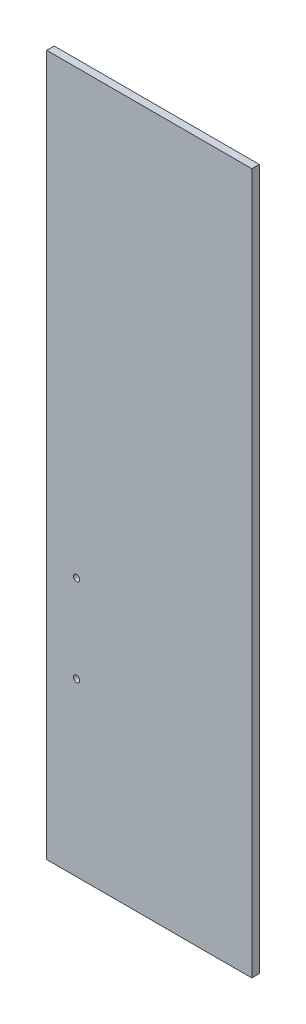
from build123d import *

# Parameters (mm, degrees)
ESQUISSE1_W                           = 275
ESQUISSE1_H                           = 940
EXTRUSION1_DEPTH                      = 10
DIAM_TRE_DU_PER_AGE_M8_5_8_500000_1_D = 8.5


with BuildPart() as part:
    # Esquisse1 → Extrusion1 (new body)
    with BuildSketch(Plane.XY):
        with Locations((137.5, 470)):
            Rectangle(ESQUISSE1_W, ESQUISSE1_H)
    extrude(amount=EXTRUSION1_DEPTH)

    # Diam_tre du per_age M8.5 _8.500000_1 (through all)
    with Locations(Plane.XY.offset(10)):
        with Locations((40, 347), (40, 230)):
            Hole(DIAM_TRE_DU_PER_AGE_M8_5_8_500000_1_D / 2)


solid = part.part
